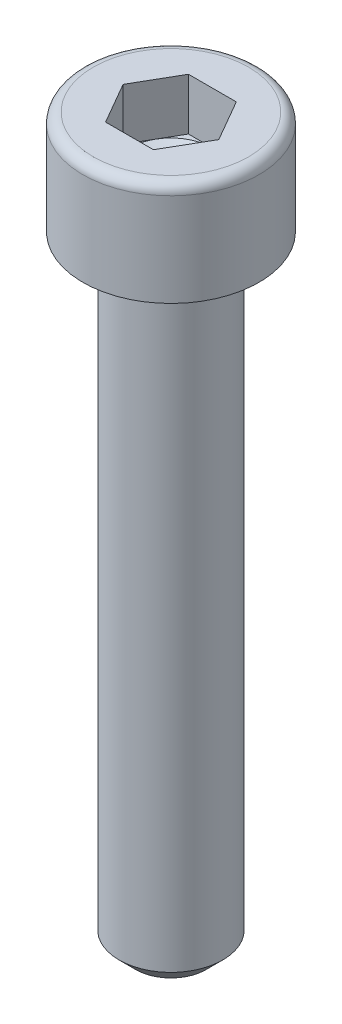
ISO-10303-21;
HEADER;
FILE_DESCRIPTION(('STEP AP214'),'2;1');
FILE_NAME('part.step','',(''),(''),'','','');
FILE_SCHEMA(('AUTOMOTIVE_DESIGN { 1 0 10303 214 1 1 1 1 }'));
ENDSEC;
DATA;
#1=APPLICATION_CONTEXT('core data for automotive mechanical design processes');
#2=APPLICATION_PROTOCOL_DEFINITION('international standard','automotive_design',2000,#1);
#3=PRODUCT_CONTEXT('',#1,'mechanical');
#4=PRODUCT('Part','Part','',(#3));
#5=PRODUCT_RELATED_PRODUCT_CATEGORY('part','',(#4));
#6=PRODUCT_DEFINITION_FORMATION('','',#4);
#7=PRODUCT_DEFINITION_CONTEXT('part definition',#1,'design');
#8=PRODUCT_DEFINITION('design','',#6,#7);
#9=PRODUCT_DEFINITION_SHAPE('','',#8);
#10=(LENGTH_UNIT() NAMED_UNIT(*) SI_UNIT(.MILLI.,.METRE.));
#11=(NAMED_UNIT(*) PLANE_ANGLE_UNIT() SI_UNIT($,.RADIAN.));
#12=(NAMED_UNIT(*) SI_UNIT($,.STERADIAN.) SOLID_ANGLE_UNIT());
#13=UNCERTAINTY_MEASURE_WITH_UNIT(LENGTH_MEASURE(1.E-05),#10,'distance_accuracy_value','');
#14=(GEOMETRIC_REPRESENTATION_CONTEXT(3) GLOBAL_UNCERTAINTY_ASSIGNED_CONTEXT((#13)) GLOBAL_UNIT_ASSIGNED_CONTEXT((#10,
#11,#12)) REPRESENTATION_CONTEXT('',''));
#15=CARTESIAN_POINT('',(0.,0.,0.));
#16=DIRECTION('',(0.,0.,1.));
#17=DIRECTION('',(1.,0.,0.));
#18=AXIS2_PLACEMENT_3D('',#15,#16,#17);
#19=CARTESIAN_POINT('',(-3.46410161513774,2.5,2.));
#20=DIRECTION('',(0.,-1.,0.));
#21=DIRECTION('',(0.,0.,-1.));
#22=AXIS2_PLACEMENT_3D('',#19,#20,#21);
#23=PLANE('',#22);
#24=DIRECTION('',(-0.499999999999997,0.,0.86602540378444));
#25=VECTOR('',#24,1.);
#26=CARTESIAN_POINT('',(1.73205080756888,2.5,0.999999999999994));
#27=LINE('',#26,#25);
#28=CARTESIAN_POINT('',(1.73205080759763,2.49999999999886,1.00000000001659));
#29=VERTEX_POINT('',#28);
#30=CARTESIAN_POINT('',(1.15470053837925,2.5,2.));
#31=VERTEX_POINT('',#30);
#32=EDGE_CURVE('E102',#29,#31,#27,.T.);
#33=ORIENTED_EDGE('',*,*,#32,.F.);
#34=CARTESIAN_POINT('',(0.,2.49999999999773,0.));
#35=DIRECTION('',(0.,1.,0.));
#36=DIRECTION('',(-1.,0.,0.));
#37=AXIS2_PLACEMENT_3D('',#34,#35,#36);
#38=CIRCLE('',#37,2.00000000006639);
#39=CARTESIAN_POINT('',(0.,2.49999999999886,2.0000000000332));
#40=VERTEX_POINT('',#39);
#41=EDGE_CURVE('E110',#29,#40,#38,.F.);
#42=ORIENTED_EDGE('',*,*,#41,.T.);
#43=DIRECTION('',(1.,0.,0.));
#44=VECTOR('',#43,1.);
#45=CARTESIAN_POINT('',(-3.46410161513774,2.5,2.));
#46=LINE('',#45,#44);
#47=EDGE_CURVE('E79',#31,#40,#46,.F.);
#48=ORIENTED_EDGE('',*,*,#47,.F.);
#49=EDGE_LOOP('',(#33,#42,#48));
#50=FACE_BOUND('',#49,.T.);
#51=ADVANCED_FACE('F16',(#50),#23,.F.);
#52=CARTESIAN_POINT('',(-3.46410161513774,2.5,2.));
#53=DIRECTION('',(0.,-1.,0.));
#54=DIRECTION('',(0.,0.,-1.));
#55=AXIS2_PLACEMENT_3D('',#52,#53,#54);
#56=PLANE('',#55);
#57=DIRECTION('',(1.,0.,0.));
#58=VECTOR('',#57,1.);
#59=CARTESIAN_POINT('',(-3.46410161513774,2.5,2.));
#60=LINE('',#59,#58);
#61=CARTESIAN_POINT('',(-1.15470053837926,2.5,2.));
#62=VERTEX_POINT('',#61);
#63=EDGE_CURVE('E261',#40,#62,#60,.F.);
#64=ORIENTED_EDGE('',*,*,#63,.F.);
#65=CARTESIAN_POINT('',(0.,2.49999999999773,0.));
#66=DIRECTION('',(0.,1.,0.));
#67=DIRECTION('',(-1.,0.,0.));
#68=AXIS2_PLACEMENT_3D('',#65,#66,#67);
#69=CIRCLE('',#68,2.00000000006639);
#70=CARTESIAN_POINT('',(-1.73205080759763,2.49999999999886,1.00000000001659));
#71=VERTEX_POINT('',#70);
#72=EDGE_CURVE('E116',#40,#71,#69,.F.);
#73=ORIENTED_EDGE('',*,*,#72,.T.);
#74=DIRECTION('',(-0.499999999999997,0.,-0.86602540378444));
#75=VECTOR('',#74,1.);
#76=CARTESIAN_POINT('',(-1.15470053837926,2.5,2.));
#77=LINE('',#76,#75);
#78=EDGE_CURVE('E259',#62,#71,#77,.T.);
#79=ORIENTED_EDGE('',*,*,#78,.F.);
#80=EDGE_LOOP('',(#64,#73,#79));
#81=FACE_BOUND('',#80,.T.);
#82=ADVANCED_FACE('F263',(#81),#56,.F.);
#83=CARTESIAN_POINT('',(-3.46410161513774,2.5,2.));
#84=DIRECTION('',(0.,-1.,0.));
#85=DIRECTION('',(0.,0.,-1.));
#86=AXIS2_PLACEMENT_3D('',#83,#84,#85);
#87=PLANE('',#86);
#88=DIRECTION('',(1.,0.,0.));
#89=VECTOR('',#88,1.);
#90=CARTESIAN_POINT('',(-3.46410161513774,2.5,-2.));
#91=LINE('',#90,#89);
#92=CARTESIAN_POINT('',(0.,2.49999999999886,-2.0000000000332));
#93=VERTEX_POINT('',#92);
#94=CARTESIAN_POINT('',(1.15470053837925,2.5,-2.));
#95=VERTEX_POINT('',#94);
#96=EDGE_CURVE('E121',#93,#95,#91,.T.);
#97=ORIENTED_EDGE('',*,*,#96,.F.);
#98=CARTESIAN_POINT('',(0.,2.49999999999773,0.));
#99=DIRECTION('',(0.,1.,0.));
#100=DIRECTION('',(-1.,0.,0.));
#101=AXIS2_PLACEMENT_3D('',#98,#99,#100);
#102=CIRCLE('',#101,2.00000000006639);
#103=CARTESIAN_POINT('',(1.73205080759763,2.49999999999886,-1.00000000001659));
#104=VERTEX_POINT('',#103);
#105=EDGE_CURVE('E96',#93,#104,#102,.F.);
#106=ORIENTED_EDGE('',*,*,#105,.T.);
#107=DIRECTION('',(0.499999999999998,0.,0.86602540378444));
#108=VECTOR('',#107,1.);
#109=CARTESIAN_POINT('',(1.15470053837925,2.5,-2.));
#110=LINE('',#109,#108);
#111=EDGE_CURVE('E117',#95,#104,#110,.T.);
#112=ORIENTED_EDGE('',*,*,#111,.F.);
#113=EDGE_LOOP('',(#97,#106,#112));
#114=FACE_BOUND('',#113,.T.);
#115=ADVANCED_FACE('F285',(#114),#87,.F.);
#116=CARTESIAN_POINT('',(0.,2.49999999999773,0.));
#117=DIRECTION('',(0.,1.,0.));
#118=DIRECTION('',(-1.,0.,0.));
#119=AXIS2_PLACEMENT_3D('',#116,#117,#118);
#120=CONICAL_SURFACE('',#119,2.00000000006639,1.04719755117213);
#121=CARTESIAN_POINT('',(-7.105427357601E-11,1.34529946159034,0.));
#122=VERTEX_POINT('',#121);
#123=VERTEX_LOOP('',#122);
#124=FACE_BOUND('',#123,.T.);
#125=ORIENTED_EDGE('',*,*,#41,.F.);
#126=CARTESIAN_POINT('',(0.,2.49999999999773,0.));
#127=DIRECTION('',(0.,1.,0.));
#128=DIRECTION('',(-1.,0.,0.));
#129=AXIS2_PLACEMENT_3D('',#126,#127,#128);
#130=CIRCLE('',#129,2.00000000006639);
#131=EDGE_CURVE('E85',#104,#29,#130,.F.);
#132=ORIENTED_EDGE('',*,*,#131,.F.);
#133=ORIENTED_EDGE('',*,*,#105,.F.);
#134=CARTESIAN_POINT('',(0.,2.49999999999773,0.));
#135=DIRECTION('',(0.,1.,0.));
#136=DIRECTION('',(-1.,0.,0.));
#137=AXIS2_PLACEMENT_3D('',#134,#135,#136);
#138=CIRCLE('',#137,2.00000000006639);
#139=CARTESIAN_POINT('',(-1.73205080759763,2.49999999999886,-1.00000000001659));
#140=VERTEX_POINT('',#139);
#141=EDGE_CURVE('E95',#93,#140,#138,.T.);
#142=ORIENTED_EDGE('',*,*,#141,.T.);
#143=CARTESIAN_POINT('',(0.,2.49999999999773,0.));
#144=DIRECTION('',(0.,1.,0.));
#145=DIRECTION('',(-1.,0.,0.));
#146=AXIS2_PLACEMENT_3D('',#143,#144,#145);
#147=CIRCLE('',#146,2.00000000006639);
#148=EDGE_CURVE('E119',#71,#140,#147,.F.);
#149=ORIENTED_EDGE('',*,*,#148,.F.);
#150=ORIENTED_EDGE('',*,*,#72,.F.);
#151=EDGE_LOOP('',(#125,#132,#133,#142,#149,#150));
#152=FACE_BOUND('',#151,.T.);
#153=ADVANCED_FACE('F114',(#124,#152),#120,.F.);
#154=CARTESIAN_POINT('',(-3.46410161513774,2.5,2.));
#155=DIRECTION('',(0.,-1.,0.));
#156=DIRECTION('',(0.,0.,-1.));
#157=AXIS2_PLACEMENT_3D('',#154,#155,#156);
#158=PLANE('',#157);
#159=DIRECTION('',(0.499999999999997,0.,-0.86602540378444));
#160=VECTOR('',#159,1.);
#161=CARTESIAN_POINT('',(-1.15470053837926,2.5,-2.));
#162=LINE('',#161,#160);
#163=CARTESIAN_POINT('',(-1.15470053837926,2.5,-2.));
#164=VERTEX_POINT('',#163);
#165=EDGE_CURVE('E203',#140,#164,#162,.T.);
#166=ORIENTED_EDGE('',*,*,#165,.F.);
#167=ORIENTED_EDGE('',*,*,#141,.F.);
#168=DIRECTION('',(1.,0.,0.));
#169=VECTOR('',#168,1.);
#170=CARTESIAN_POINT('',(1.15470053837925,2.5,-2.));
#171=LINE('',#170,#169);
#172=EDGE_CURVE('E204',#164,#93,#171,.T.);
#173=ORIENTED_EDGE('',*,*,#172,.F.);
#174=EDGE_LOOP('',(#166,#167,#173));
#175=FACE_BOUND('',#174,.T.);
#176=ADVANCED_FACE('F245',(#175),#158,.F.);
#177=CARTESIAN_POINT('',(-3.46410161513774,2.5,2.));
#178=DIRECTION('',(0.,-1.,0.));
#179=DIRECTION('',(0.,0.,-1.));
#180=AXIS2_PLACEMENT_3D('',#177,#178,#179);
#181=PLANE('',#180);
#182=DIRECTION('',(-0.499999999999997,0.,-0.86602540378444));
#183=VECTOR('',#182,1.);
#184=CARTESIAN_POINT('',(-1.15470053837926,2.5,2.));
#185=LINE('',#184,#183);
#186=CARTESIAN_POINT('',(-2.3094010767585,2.5,0.));
#187=VERTEX_POINT('',#186);
#188=EDGE_CURVE('E189',#71,#187,#185,.T.);
#189=ORIENTED_EDGE('',*,*,#188,.F.);
#190=ORIENTED_EDGE('',*,*,#148,.T.);
#191=DIRECTION('',(0.499999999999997,0.,-0.86602540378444));
#192=VECTOR('',#191,1.);
#193=CARTESIAN_POINT('',(-1.15470053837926,2.5,-2.));
#194=LINE('',#193,#192);
#195=EDGE_CURVE('E200',#187,#140,#194,.T.);
#196=ORIENTED_EDGE('',*,*,#195,.F.);
#197=EDGE_LOOP('',(#189,#190,#196));
#198=FACE_BOUND('',#197,.T.);
#199=ADVANCED_FACE('F239',(#198),#181,.F.);
#200=CARTESIAN_POINT('',(-3.46410161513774,2.5,2.));
#201=DIRECTION('',(0.,-1.,0.));
#202=DIRECTION('',(0.,0.,-1.));
#203=AXIS2_PLACEMENT_3D('',#200,#201,#202);
#204=PLANE('',#203);
#205=DIRECTION('',(0.499999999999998,0.,0.86602540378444));
#206=VECTOR('',#205,1.);
#207=CARTESIAN_POINT('',(1.15470053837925,2.5,-2.));
#208=LINE('',#207,#206);
#209=CARTESIAN_POINT('',(2.3094010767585,2.5,0.));
#210=VERTEX_POINT('',#209);
#211=EDGE_CURVE('E91',#104,#210,#208,.T.);
#212=ORIENTED_EDGE('',*,*,#211,.F.);
#213=ORIENTED_EDGE('',*,*,#131,.T.);
#214=DIRECTION('',(-0.499999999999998,0.,0.86602540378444));
#215=VECTOR('',#214,1.);
#216=CARTESIAN_POINT('',(1.15470053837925,2.5,2.));
#217=LINE('',#216,#215);
#218=EDGE_CURVE('E88',#210,#29,#217,.T.);
#219=ORIENTED_EDGE('',*,*,#218,.F.);
#220=EDGE_LOOP('',(#212,#213,#219));
#221=FACE_BOUND('',#220,.T.);
#222=ADVANCED_FACE('F87',(#221),#204,.F.);
#223=CARTESIAN_POINT('',(1.15470053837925,2.5,-2.));
#224=DIRECTION('',(0.,0.,1.));
#225=DIRECTION('',(1.,0.,0.));
#226=AXIS2_PLACEMENT_3D('',#223,#224,#225);
#227=PLANE('',#226);
#228=ORIENTED_EDGE('',*,*,#96,.T.);
#229=DIRECTION('',(0.,1.,0.));
#230=VECTOR('',#229,1.);
#231=CARTESIAN_POINT('',(1.15470053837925,2.5,-2.));
#232=LINE('',#231,#230);
#233=CARTESIAN_POINT('',(1.15470053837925,5.,-2.));
#234=VERTEX_POINT('',#233);
#235=EDGE_CURVE('E181',#234,#95,#232,.F.);
#236=ORIENTED_EDGE('',*,*,#235,.F.);
#237=DIRECTION('',(1.,0.,0.));
#238=VECTOR('',#237,1.);
#239=CARTESIAN_POINT('',(2.,5.,-2.));
#240=LINE('',#239,#238);
#241=CARTESIAN_POINT('',(-1.15470053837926,5.,-2.));
#242=VERTEX_POINT('',#241);
#243=EDGE_CURVE('E165',#234,#242,#240,.F.);
#244=ORIENTED_EDGE('',*,*,#243,.T.);
#245=DIRECTION('',(0.,1.,0.));
#246=VECTOR('',#245,1.);
#247=CARTESIAN_POINT('',(-1.15470053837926,2.5,-2.));
#248=LINE('',#247,#246);
#249=EDGE_CURVE('E193',#164,#242,#248,.T.);
#250=ORIENTED_EDGE('',*,*,#249,.F.);
#251=ORIENTED_EDGE('',*,*,#172,.T.);
#252=EDGE_LOOP('',(#228,#236,#244,#250,#251));
#253=FACE_BOUND('',#252,.T.);
#254=ADVANCED_FACE('F277',(#253),#227,.T.);
#255=CARTESIAN_POINT('',(-1.15470053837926,2.5,-2.));
#256=DIRECTION('',(0.86602540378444,0.,0.499999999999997));
#257=DIRECTION('',(0.499999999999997,0.,-0.86602540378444));
#258=AXIS2_PLACEMENT_3D('',#255,#256,#257);
#259=PLANE('',#258);
#260=ORIENTED_EDGE('',*,*,#165,.T.);
#261=ORIENTED_EDGE('',*,*,#249,.T.);
#262=DIRECTION('',(-0.499999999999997,0.,0.86602540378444));
#263=VECTOR('',#262,1.);
#264=CARTESIAN_POINT('',(-1.15470053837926,5.,-2.));
#265=LINE('',#264,#263);
#266=CARTESIAN_POINT('',(-2.3094010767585,5.,0.));
#267=VERTEX_POINT('',#266);
#268=EDGE_CURVE('E252',#242,#267,#265,.T.);
#269=ORIENTED_EDGE('',*,*,#268,.T.);
#270=DIRECTION('',(0.,1.,0.));
#271=VECTOR('',#270,1.);
#272=CARTESIAN_POINT('',(-2.3094010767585,2.5,0.));
#273=LINE('',#272,#271);
#274=EDGE_CURVE('E192',#187,#267,#273,.T.);
#275=ORIENTED_EDGE('',*,*,#274,.F.);
#276=ORIENTED_EDGE('',*,*,#195,.T.);
#277=EDGE_LOOP('',(#260,#261,#269,#275,#276));
#278=FACE_BOUND('',#277,.T.);
#279=ADVANCED_FACE('F248',(#278),#259,.T.);
#280=CARTESIAN_POINT('',(-1.15470053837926,2.5,2.));
#281=DIRECTION('',(0.86602540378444,0.,-0.499999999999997));
#282=DIRECTION('',(-0.499999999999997,0.,-0.86602540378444));
#283=AXIS2_PLACEMENT_3D('',#280,#281,#282);
#284=PLANE('',#283);
#285=ORIENTED_EDGE('',*,*,#188,.T.);
#286=ORIENTED_EDGE('',*,*,#274,.T.);
#287=DIRECTION('',(0.499999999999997,0.,0.86602540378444));
#288=VECTOR('',#287,1.);
#289=CARTESIAN_POINT('',(-2.3094010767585,5.,0.));
#290=LINE('',#289,#288);
#291=CARTESIAN_POINT('',(-1.15470053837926,5.,2.));
#292=VERTEX_POINT('',#291);
#293=EDGE_CURVE('E434',#267,#292,#290,.T.);
#294=ORIENTED_EDGE('',*,*,#293,.T.);
#295=DIRECTION('',(0.,1.,0.));
#296=VECTOR('',#295,1.);
#297=CARTESIAN_POINT('',(-1.15470053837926,2.5,2.));
#298=LINE('',#297,#296);
#299=EDGE_CURVE('E107',#62,#292,#298,.T.);
#300=ORIENTED_EDGE('',*,*,#299,.F.);
#301=ORIENTED_EDGE('',*,*,#78,.T.);
#302=EDGE_LOOP('',(#285,#286,#294,#300,#301));
#303=FACE_BOUND('',#302,.T.);
#304=ADVANCED_FACE('F256',(#303),#284,.T.);
#305=CARTESIAN_POINT('',(1.15470053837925,2.5,2.));
#306=DIRECTION('',(0.,0.,-1.));
#307=DIRECTION('',(-1.,0.,0.));
#308=AXIS2_PLACEMENT_3D('',#305,#306,#307);
#309=PLANE('',#308);
#310=ORIENTED_EDGE('',*,*,#63,.T.);
#311=ORIENTED_EDGE('',*,*,#299,.T.);
#312=DIRECTION('',(1.,0.,0.));
#313=VECTOR('',#312,1.);
#314=CARTESIAN_POINT('',(2.,5.,2.));
#315=LINE('',#314,#313);
#316=CARTESIAN_POINT('',(1.15470053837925,5.,2.));
#317=VERTEX_POINT('',#316);
#318=EDGE_CURVE('E435',#292,#317,#315,.T.);
#319=ORIENTED_EDGE('',*,*,#318,.T.);
#320=DIRECTION('',(0.,1.,0.));
#321=VECTOR('',#320,1.);
#322=CARTESIAN_POINT('',(1.15470053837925,2.5,2.));
#323=LINE('',#322,#321);
#324=EDGE_CURVE('E106',#31,#317,#323,.T.);
#325=ORIENTED_EDGE('',*,*,#324,.F.);
#326=ORIENTED_EDGE('',*,*,#47,.T.);
#327=EDGE_LOOP('',(#310,#311,#319,#325,#326));
#328=FACE_BOUND('',#327,.T.);
#329=ADVANCED_FACE('F358',(#328),#309,.T.);
#330=CARTESIAN_POINT('',(1.15470053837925,2.5,2.));
#331=DIRECTION('',(-0.86602540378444,0.,-0.499999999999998));
#332=DIRECTION('',(-0.499999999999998,0.,0.86602540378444));
#333=AXIS2_PLACEMENT_3D('',#330,#331,#332);
#334=PLANE('',#333);
#335=ORIENTED_EDGE('',*,*,#32,.T.);
#336=ORIENTED_EDGE('',*,*,#324,.T.);
#337=DIRECTION('',(0.499999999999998,0.,-0.86602540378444));
#338=VECTOR('',#337,1.);
#339=CARTESIAN_POINT('',(1.15470053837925,5.,2.));
#340=LINE('',#339,#338);
#341=CARTESIAN_POINT('',(2.3094010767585,5.,0.));
#342=VERTEX_POINT('',#341);
#343=EDGE_CURVE('E438',#317,#342,#340,.T.);
#344=ORIENTED_EDGE('',*,*,#343,.T.);
#345=DIRECTION('',(0.,1.,0.));
#346=VECTOR('',#345,1.);
#347=CARTESIAN_POINT('',(2.3094010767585,2.5,0.));
#348=LINE('',#347,#346);
#349=EDGE_CURVE('E105',#210,#342,#348,.T.);
#350=ORIENTED_EDGE('',*,*,#349,.F.);
#351=ORIENTED_EDGE('',*,*,#218,.T.);
#352=EDGE_LOOP('',(#335,#336,#344,#350,#351));
#353=FACE_BOUND('',#352,.T.);
#354=ADVANCED_FACE('F100',(#353),#334,.T.);
#355=CARTESIAN_POINT('',(1.15470053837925,2.5,-2.));
#356=DIRECTION('',(-0.86602540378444,0.,0.499999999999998));
#357=DIRECTION('',(0.499999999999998,0.,0.86602540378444));
#358=AXIS2_PLACEMENT_3D('',#355,#356,#357);
#359=PLANE('',#358);
#360=ORIENTED_EDGE('',*,*,#211,.T.);
#361=ORIENTED_EDGE('',*,*,#349,.T.);
#362=DIRECTION('',(-0.499999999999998,0.,-0.86602540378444));
#363=VECTOR('',#362,1.);
#364=CARTESIAN_POINT('',(2.3094010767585,5.,0.));
#365=LINE('',#364,#363);
#366=EDGE_CURVE('E129',#342,#234,#365,.T.);
#367=ORIENTED_EDGE('',*,*,#366,.T.);
#368=ORIENTED_EDGE('',*,*,#235,.T.);
#369=ORIENTED_EDGE('',*,*,#111,.T.);
#370=EDGE_LOOP('',(#360,#361,#367,#368,#369));
#371=FACE_BOUND('',#370,.T.);
#372=ADVANCED_FACE('F150',(#371),#359,.T.);
#373=CARTESIAN_POINT('',(2.,5.,0.));
#374=DIRECTION('',(0.,-1.,0.));
#375=DIRECTION('',(1.,0.,0.));
#376=AXIS2_PLACEMENT_3D('',#373,#374,#375);
#377=PLANE('',#376);
#378=ORIENTED_EDGE('',*,*,#343,.F.);
#379=ORIENTED_EDGE('',*,*,#318,.F.);
#380=ORIENTED_EDGE('',*,*,#293,.F.);
#381=ORIENTED_EDGE('',*,*,#268,.F.);
#382=ORIENTED_EDGE('',*,*,#243,.F.);
#383=ORIENTED_EDGE('',*,*,#366,.F.);
#384=EDGE_LOOP('',(#378,#379,#380,#381,#382,#383));
#385=FACE_BOUND('',#384,.T.);
#386=CARTESIAN_POINT('',(0.,5.,0.));
#387=DIRECTION('',(0.,-1.,0.));
#388=DIRECTION('',(-1.,0.,0.));
#389=AXIS2_PLACEMENT_3D('',#386,#387,#388);
#390=CIRCLE('',#389,3.75);
#391=CARTESIAN_POINT('',(-3.75,5.,0.));
#392=VERTEX_POINT('',#391);
#393=CARTESIAN_POINT('',(3.75,5.,0.));
#394=VERTEX_POINT('',#393);
#395=EDGE_CURVE('E36',#392,#394,#390,.T.);
#396=ORIENTED_EDGE('',*,*,#395,.F.);
#397=CARTESIAN_POINT('',(0.,5.,0.));
#398=DIRECTION('',(0.,-1.,0.));
#399=DIRECTION('',(1.,0.,0.));
#400=AXIS2_PLACEMENT_3D('',#397,#398,#399);
#401=CIRCLE('',#400,3.75);
#402=EDGE_CURVE('E127',#394,#392,#401,.T.);
#403=ORIENTED_EDGE('',*,*,#402,.F.);
#404=EDGE_LOOP('',(#396,#403));
#405=FACE_BOUND('',#404,.T.);
#406=ADVANCED_FACE('F131',(#385,#405),#377,.F.);
#407=CARTESIAN_POINT('',(0.,4.5,0.));
#408=DIRECTION('',(0.,1.,0.));
#409=DIRECTION('',(-1.,0.,0.));
#410=AXIS2_PLACEMENT_3D('',#407,#408,#409);
#411=TOROIDAL_SURFACE('',#410,3.75,0.5);
#412=ORIENTED_EDGE('',*,*,#395,.T.);
#413=ORIENTED_EDGE('',*,*,#402,.T.);
#414=EDGE_LOOP('',(#412,#413));
#415=FACE_BOUND('',#414,.T.);
#416=CARTESIAN_POINT('',(0.,4.5,0.));
#417=DIRECTION('',(0.,1.,0.));
#418=DIRECTION('',(-1.,0.,0.));
#419=AXIS2_PLACEMENT_3D('',#416,#417,#418);
#420=CIRCLE('',#419,4.25);
#421=CARTESIAN_POINT('',(-4.25,4.5,0.));
#422=VERTEX_POINT('',#421);
#423=EDGE_CURVE('E132',#422,#422,#420,.F.);
#424=ORIENTED_EDGE('',*,*,#423,.F.);
#425=EDGE_LOOP('',(#424));
#426=FACE_BOUND('',#425,.T.);
#427=ADVANCED_FACE('F125',(#415,#426),#411,.T.);
#428=CARTESIAN_POINT('',(0.,-30.,0.));
#429=DIRECTION('',(0.,1.,0.));
#430=DIRECTION('',(0.,0.,1.));
#431=AXIS2_PLACEMENT_3D('',#428,#429,#430);
#432=PLANE('',#431);
#433=CARTESIAN_POINT('',(0.,-30.0000000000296,0.));
#434=DIRECTION('',(0.,1.,0.));
#435=DIRECTION('',(0.,0.,1.));
#436=AXIS2_PLACEMENT_3D('',#433,#434,#435);
#437=CIRCLE('',#436,1.70000000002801);
#438=CARTESIAN_POINT('',(0.,-30.0000000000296,1.70000000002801));
#439=VERTEX_POINT('',#438);
#440=EDGE_CURVE('E171',#439,#439,#437,.T.);
#441=ORIENTED_EDGE('',*,*,#440,.F.);
#442=EDGE_LOOP('',(#441));
#443=FACE_BOUND('',#442,.T.);
#444=ADVANCED_FACE('F158',(#443),#432,.F.);
#445=CARTESIAN_POINT('',(0.,5.,0.));
#446=DIRECTION('',(0.,1.,0.));
#447=DIRECTION('',(-1.,0.,0.));
#448=AXIS2_PLACEMENT_3D('',#445,#446,#447);
#449=CYLINDRICAL_SURFACE('',#448,4.25);
#450=ORIENTED_EDGE('',*,*,#423,.T.);
#451=EDGE_LOOP('',(#450));
#452=FACE_BOUND('',#451,.T.);
#453=CARTESIAN_POINT('',(0.,0.,0.));
#454=DIRECTION('',(0.,1.,0.));
#455=DIRECTION('',(-1.,0.,0.));
#456=AXIS2_PLACEMENT_3D('',#453,#454,#455);
#457=CIRCLE('',#456,4.25);
#458=CARTESIAN_POINT('',(-4.25,0.,0.));
#459=VERTEX_POINT('',#458);
#460=EDGE_CURVE('E169',#459,#459,#457,.T.);
#461=ORIENTED_EDGE('',*,*,#460,.T.);
#462=EDGE_LOOP('',(#461));
#463=FACE_BOUND('',#462,.T.);
#464=ADVANCED_FACE('F310',(#452,#463),#449,.T.);
#465=CARTESIAN_POINT('',(0.,-29.2000000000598,0.));
#466=DIRECTION('',(0.,1.,0.));
#467=DIRECTION('',(0.,0.,1.));
#468=AXIS2_PLACEMENT_3D('',#465,#466,#467);
#469=CONICAL_SURFACE('',#468,2.49999999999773,0.785398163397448);
#470=ORIENTED_EDGE('',*,*,#440,.T.);
#471=EDGE_LOOP('',(#470));
#472=FACE_BOUND('',#471,.T.);
#473=CARTESIAN_POINT('',(0.,-29.2,0.));
#474=DIRECTION('',(0.,1.,0.));
#475=DIRECTION('',(0.,0.,1.));
#476=AXIS2_PLACEMENT_3D('',#473,#474,#475);
#477=CIRCLE('',#476,2.5);
#478=CARTESIAN_POINT('',(0.,-29.2,2.5));
#479=VERTEX_POINT('',#478);
#480=EDGE_CURVE('E28',#479,#479,#477,.T.);
#481=ORIENTED_EDGE('',*,*,#480,.F.);
#482=EDGE_LOOP('',(#481));
#483=FACE_BOUND('',#482,.T.);
#484=ADVANCED_FACE('F302',(#472,#483),#469,.T.);
#485=CARTESIAN_POINT('',(0.,0.,0.));
#486=DIRECTION('',(0.,1.,0.));
#487=DIRECTION('',(-1.,0.,0.));
#488=AXIS2_PLACEMENT_3D('',#485,#486,#487);
#489=PLANE('',#488);
#490=ORIENTED_EDGE('',*,*,#460,.F.);
#491=EDGE_LOOP('',(#490));
#492=FACE_BOUND('',#491,.T.);
#493=CARTESIAN_POINT('',(0.,0.,0.));
#494=DIRECTION('',(0.,1.,0.));
#495=DIRECTION('',(0.,0.,1.));
#496=AXIS2_PLACEMENT_3D('',#493,#494,#495);
#497=CIRCLE('',#496,2.5);
#498=CARTESIAN_POINT('',(0.,0.,2.5));
#499=VERTEX_POINT('',#498);
#500=EDGE_CURVE('E10',#499,#499,#497,.F.);
#501=ORIENTED_EDGE('',*,*,#500,.F.);
#502=EDGE_LOOP('',(#501));
#503=FACE_BOUND('',#502,.T.);
#504=ADVANCED_FACE('F297',(#492,#503),#489,.F.);
#505=CARTESIAN_POINT('',(0.,-30.,0.));
#506=DIRECTION('',(0.,1.,0.));
#507=DIRECTION('',(0.,0.,1.));
#508=AXIS2_PLACEMENT_3D('',#505,#506,#507);
#509=CYLINDRICAL_SURFACE('',#508,2.5);
#510=ORIENTED_EDGE('',*,*,#480,.T.);
#511=EDGE_LOOP('',(#510));
#512=FACE_BOUND('',#511,.T.);
#513=ORIENTED_EDGE('',*,*,#500,.T.);
#514=EDGE_LOOP('',(#513));
#515=FACE_BOUND('',#514,.T.);
#516=ADVANCED_FACE('F18',(#512,#515),#509,.T.);
#517=CLOSED_SHELL('',(#51,#82,#115,#153,#176,#199,#222,#254,#279,#304,#329,#354,#372,#406,#427,
#444,#464,#484,#504,#516));
#518=MANIFOLD_SOLID_BREP('B1',#517);
#519=ADVANCED_BREP_SHAPE_REPRESENTATION('',(#18,#518),#14);
#520=SHAPE_DEFINITION_REPRESENTATION(#9,#519);
ENDSEC;
END-ISO-10303-21;
